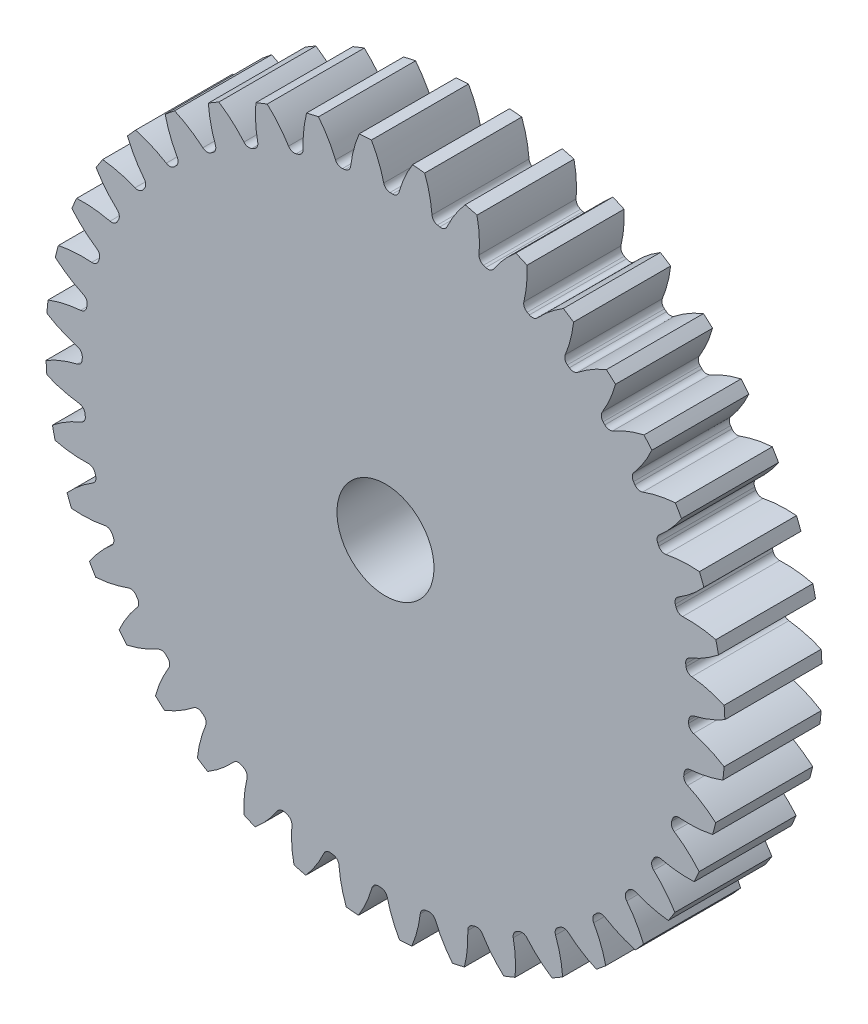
from build123d import *

# Parameters (mm, degrees)
SKETCH3_R         = 355.6
GEARBODY_DEPTH    = 101.6
TOOTHCUT_DEPTH    = 514.054850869
CIRPATTERN1_COUNT = 40
BOREDIA_R         = 50.8
BORE_DEPTH        = 12700


with BuildPart() as part:
    # Sketch3 → gearBody (new body)
    with BuildSketch(Plane.XY):
        Circle(SKETCH3_R)
    extrude(amount=GEARBODY_DEPTH)

    # Sketch2 → toothCut (cut, through all)
    with BuildSketch(Plane.XY):
        with BuildLine():
            ThreePointArc((317.414149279, -7.38294234), (317.441741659, -6.081994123), (317.464002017, -4.780943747))
            ThreePointArc((317.464002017, -4.780943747), (318.976251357, -0.575899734), (322.74990002, 1.817605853))
            ThreePointArc((322.74990002, 1.817605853), (339.645925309, 7.173501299), (355.6, 14.895469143))
            ThreePointArc((355.6, 14.895469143), (355.846529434, -6.817806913), (354.768459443, -28.505704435))
            ThreePointArc((354.768459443, -28.505704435), (339.121881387, -20.178286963), (322.443412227, -14.179124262))
            ThreePointArc((322.443412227, -14.179124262), (318.76421565, -11.642826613), (317.414149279, -7.38294234))
        make_face()
    toothcut = extrude(amount=TOOTHCUT_DEPTH, mode=Mode.SUBTRACT)

    # CirPattern1: toothCut ×40 about axis
    cirpattern1_axis = Axis((0, 0, 0), (0, 0, 1))
    for i in range(1, CIRPATTERN1_COUNT):
        add(toothcut.rotate(cirpattern1_axis, i * 360 / CIRPATTERN1_COUNT), mode=Mode.SUBTRACT)

    # boreDia → bore (cut, symmetric)
    with BuildSketch(Plane.XY):
        Circle(BOREDIA_R)
    extrude(amount=BORE_DEPTH, both=True, mode=Mode.SUBTRACT)


solid = part.part
